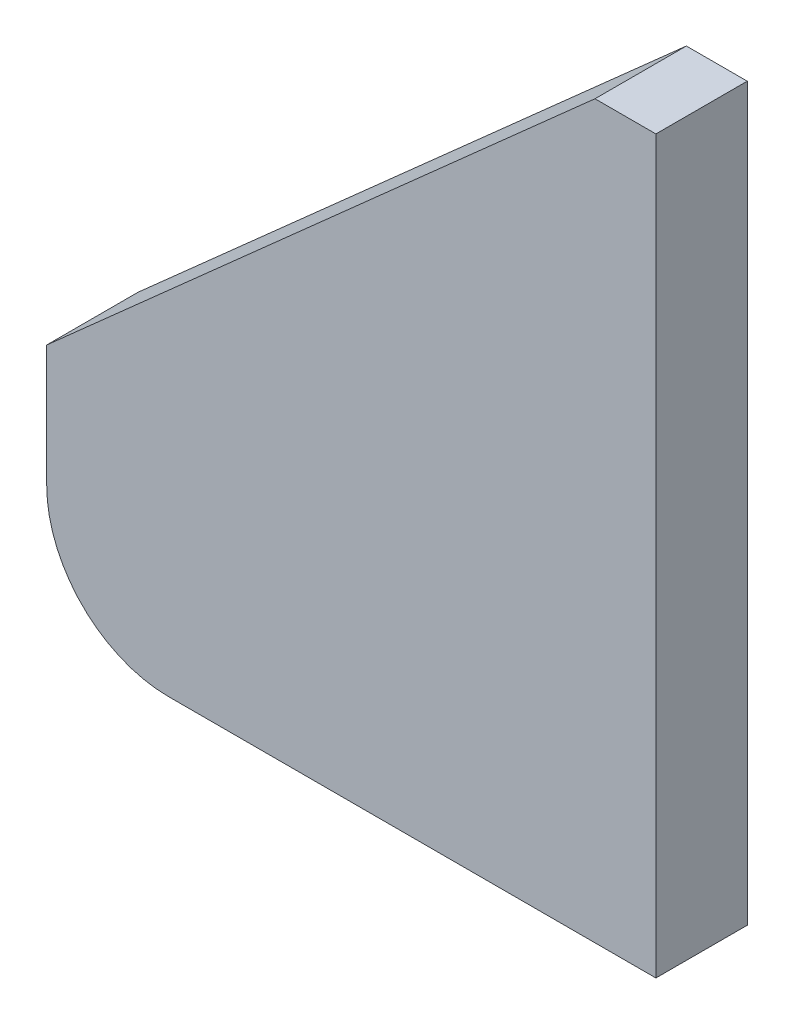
ISO-10303-21;
HEADER;
FILE_DESCRIPTION(('STEP AP214'),'2;1');
FILE_NAME('part.step','',(''),(''),'','','');
FILE_SCHEMA(('AUTOMOTIVE_DESIGN { 1 0 10303 214 1 1 1 1 }'));
ENDSEC;
DATA;
#1=APPLICATION_CONTEXT('core data for automotive mechanical design processes');
#2=APPLICATION_PROTOCOL_DEFINITION('international standard','automotive_design',2000,#1);
#3=PRODUCT_CONTEXT('',#1,'mechanical');
#4=PRODUCT('Part','Part','',(#3));
#5=PRODUCT_RELATED_PRODUCT_CATEGORY('part','',(#4));
#6=PRODUCT_DEFINITION_FORMATION('','',#4);
#7=PRODUCT_DEFINITION_CONTEXT('part definition',#1,'design');
#8=PRODUCT_DEFINITION('design','',#6,#7);
#9=PRODUCT_DEFINITION_SHAPE('','',#8);
#10=(LENGTH_UNIT() NAMED_UNIT(*) SI_UNIT(.MILLI.,.METRE.));
#11=(NAMED_UNIT(*) PLANE_ANGLE_UNIT() SI_UNIT($,.RADIAN.));
#12=(NAMED_UNIT(*) SI_UNIT($,.STERADIAN.) SOLID_ANGLE_UNIT());
#13=UNCERTAINTY_MEASURE_WITH_UNIT(LENGTH_MEASURE(1.E-05),#10,'distance_accuracy_value','');
#14=(GEOMETRIC_REPRESENTATION_CONTEXT(3) GLOBAL_UNCERTAINTY_ASSIGNED_CONTEXT((#13)) GLOBAL_UNIT_ASSIGNED_CONTEXT((#10,
#11,#12)) REPRESENTATION_CONTEXT('',''));
#15=CARTESIAN_POINT('',(0.,0.,0.));
#16=DIRECTION('',(0.,0.,1.));
#17=DIRECTION('',(1.,0.,0.));
#18=AXIS2_PLACEMENT_3D('',#15,#16,#17);
#19=CARTESIAN_POINT('',(-80.,20.,15.));
#20=DIRECTION('',(0.,0.,-1.));
#21=DIRECTION('',(-1.,0.,0.));
#22=AXIS2_PLACEMENT_3D('',#19,#20,#21);
#23=CYLINDRICAL_SURFACE('',#22,20.);
#24=CARTESIAN_POINT('',(-80.,20.,0.));
#25=DIRECTION('',(0.,0.,1.));
#26=DIRECTION('',(-1.,0.,0.));
#27=AXIS2_PLACEMENT_3D('',#24,#25,#26);
#28=CIRCLE('',#27,20.);
#29=CARTESIAN_POINT('',(-100.,20.0000000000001,0.));
#30=VERTEX_POINT('',#29);
#31=CARTESIAN_POINT('',(-79.9999999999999,0.,0.));
#32=VERTEX_POINT('',#31);
#33=EDGE_CURVE('E87',#30,#32,#28,.T.);
#34=ORIENTED_EDGE('',*,*,#33,.T.);
#35=DIRECTION('',(0.,0.,-1.));
#36=VECTOR('',#35,1.);
#37=CARTESIAN_POINT('',(-79.9999999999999,0.,15.));
#38=LINE('',#37,#36);
#39=CARTESIAN_POINT('',(-79.9999999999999,0.,15.));
#40=VERTEX_POINT('',#39);
#41=EDGE_CURVE('E11',#40,#32,#38,.T.);
#42=ORIENTED_EDGE('',*,*,#41,.F.);
#43=CARTESIAN_POINT('',(-80.,20.,15.));
#44=DIRECTION('',(0.,0.,1.));
#45=DIRECTION('',(-1.,0.,0.));
#46=AXIS2_PLACEMENT_3D('',#43,#44,#45);
#47=CIRCLE('',#46,20.);
#48=CARTESIAN_POINT('',(-100.,20.0000000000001,15.));
#49=VERTEX_POINT('',#48);
#50=EDGE_CURVE('E110',#49,#40,#47,.T.);
#51=ORIENTED_EDGE('',*,*,#50,.F.);
#52=DIRECTION('',(0.,0.,-1.));
#53=VECTOR('',#52,1.);
#54=CARTESIAN_POINT('',(-100.,20.0000000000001,15.));
#55=LINE('',#54,#53);
#56=EDGE_CURVE('E100',#49,#30,#55,.T.);
#57=ORIENTED_EDGE('',*,*,#56,.T.);
#58=EDGE_LOOP('',(#34,#42,#51,#57));
#59=FACE_BOUND('',#58,.T.);
#60=ADVANCED_FACE('F31',(#59),#23,.T.);
#61=CARTESIAN_POINT('',(-79.9999999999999,0.,15.));
#62=DIRECTION('',(0.,1.,0.));
#63=DIRECTION('',(0.,0.,1.));
#64=AXIS2_PLACEMENT_3D('',#61,#62,#63);
#65=PLANE('',#64);
#66=DIRECTION('',(1.,0.,0.));
#67=VECTOR('',#66,1.);
#68=CARTESIAN_POINT('',(-79.9999999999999,0.,0.));
#69=LINE('',#68,#67);
#70=CARTESIAN_POINT('',(0.,0.,0.));
#71=VERTEX_POINT('',#70);
#72=EDGE_CURVE('E83',#32,#71,#69,.T.);
#73=ORIENTED_EDGE('',*,*,#72,.T.);
#74=DIRECTION('',(0.,0.,-1.));
#75=VECTOR('',#74,1.);
#76=CARTESIAN_POINT('',(0.,0.,15.));
#77=LINE('',#76,#75);
#78=CARTESIAN_POINT('',(0.,0.,15.));
#79=VERTEX_POINT('',#78);
#80=EDGE_CURVE('E38',#79,#71,#77,.T.);
#81=ORIENTED_EDGE('',*,*,#80,.F.);
#82=DIRECTION('',(1.,0.,0.));
#83=VECTOR('',#82,1.);
#84=CARTESIAN_POINT('',(-79.9999999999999,0.,15.));
#85=LINE('',#84,#83);
#86=EDGE_CURVE('E96',#40,#79,#85,.T.);
#87=ORIENTED_EDGE('',*,*,#86,.F.);
#88=ORIENTED_EDGE('',*,*,#41,.T.);
#89=EDGE_LOOP('',(#73,#81,#87,#88));
#90=FACE_BOUND('',#89,.T.);
#91=ADVANCED_FACE('F95',(#90),#65,.F.);
#92=CARTESIAN_POINT('',(0.,120.,15.));
#93=DIRECTION('',(-1.,0.,0.));
#94=DIRECTION('',(0.,-1.,0.));
#95=AXIS2_PLACEMENT_3D('',#92,#93,#94);
#96=PLANE('',#95);
#97=DIRECTION('',(0.,1.,0.));
#98=VECTOR('',#97,1.);
#99=CARTESIAN_POINT('',(0.,120.,0.));
#100=LINE('',#99,#98);
#101=CARTESIAN_POINT('',(0.,120.,0.));
#102=VERTEX_POINT('',#101);
#103=EDGE_CURVE('E89',#71,#102,#100,.T.);
#104=ORIENTED_EDGE('',*,*,#103,.T.);
#105=DIRECTION('',(0.,0.,-1.));
#106=VECTOR('',#105,1.);
#107=CARTESIAN_POINT('',(0.,120.,15.));
#108=LINE('',#107,#106);
#109=CARTESIAN_POINT('',(0.,120.,15.));
#110=VERTEX_POINT('',#109);
#111=EDGE_CURVE('E126',#110,#102,#108,.T.);
#112=ORIENTED_EDGE('',*,*,#111,.F.);
#113=DIRECTION('',(0.,1.,0.));
#114=VECTOR('',#113,1.);
#115=CARTESIAN_POINT('',(0.,120.,15.));
#116=LINE('',#115,#114);
#117=EDGE_CURVE('E113',#79,#110,#116,.T.);
#118=ORIENTED_EDGE('',*,*,#117,.F.);
#119=ORIENTED_EDGE('',*,*,#80,.T.);
#120=EDGE_LOOP('',(#104,#112,#118,#119));
#121=FACE_BOUND('',#120,.T.);
#122=ADVANCED_FACE('F130',(#121),#96,.F.);
#123=CARTESIAN_POINT('',(-10.,120.,15.));
#124=DIRECTION('',(0.,-1.,0.));
#125=DIRECTION('',(0.,0.,-1.));
#126=AXIS2_PLACEMENT_3D('',#123,#124,#125);
#127=PLANE('',#126);
#128=DIRECTION('',(-1.,0.,0.));
#129=VECTOR('',#128,1.);
#130=CARTESIAN_POINT('',(-10.,120.,0.));
#131=LINE('',#130,#129);
#132=CARTESIAN_POINT('',(-10.,120.,0.));
#133=VERTEX_POINT('',#132);
#134=EDGE_CURVE('E104',#102,#133,#131,.T.);
#135=ORIENTED_EDGE('',*,*,#134,.T.);
#136=DIRECTION('',(0.,0.,-1.));
#137=VECTOR('',#136,1.);
#138=CARTESIAN_POINT('',(-10.,120.,15.));
#139=LINE('',#138,#137);
#140=CARTESIAN_POINT('',(-10.,120.,15.));
#141=VERTEX_POINT('',#140);
#142=EDGE_CURVE('E123',#141,#133,#139,.T.);
#143=ORIENTED_EDGE('',*,*,#142,.F.);
#144=DIRECTION('',(-1.,0.,0.));
#145=VECTOR('',#144,1.);
#146=CARTESIAN_POINT('',(-10.,120.,15.));
#147=LINE('',#146,#145);
#148=EDGE_CURVE('E115',#110,#141,#147,.T.);
#149=ORIENTED_EDGE('',*,*,#148,.F.);
#150=ORIENTED_EDGE('',*,*,#111,.T.);
#151=EDGE_LOOP('',(#135,#143,#149,#150));
#152=FACE_BOUND('',#151,.T.);
#153=ADVANCED_FACE('F136',(#152),#127,.F.);
#154=CARTESIAN_POINT('',(-10.,120.,15.));
#155=DIRECTION('',(0.66436383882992,-0.74740931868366,0.));
#156=DIRECTION('',(0.74740931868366,0.66436383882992,0.));
#157=AXIS2_PLACEMENT_3D('',#154,#155,#156);
#158=PLANE('',#157);
#159=DIRECTION('',(-0.74740931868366,-0.66436383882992,0.));
#160=VECTOR('',#159,1.);
#161=CARTESIAN_POINT('',(-10.,120.,0.));
#162=LINE('',#161,#160);
#163=CARTESIAN_POINT('',(-100.,40.,0.));
#164=VERTEX_POINT('',#163);
#165=EDGE_CURVE('E106',#133,#164,#162,.T.);
#166=ORIENTED_EDGE('',*,*,#165,.T.);
#167=DIRECTION('',(0.,0.,-1.));
#168=VECTOR('',#167,1.);
#169=CARTESIAN_POINT('',(-100.,40.,15.));
#170=LINE('',#169,#168);
#171=CARTESIAN_POINT('',(-100.,40.,15.));
#172=VERTEX_POINT('',#171);
#173=EDGE_CURVE('E120',#172,#164,#170,.T.);
#174=ORIENTED_EDGE('',*,*,#173,.F.);
#175=DIRECTION('',(-0.74740931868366,-0.66436383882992,0.));
#176=VECTOR('',#175,1.);
#177=CARTESIAN_POINT('',(-10.,120.,15.));
#178=LINE('',#177,#176);
#179=EDGE_CURVE('E50',#141,#172,#178,.T.);
#180=ORIENTED_EDGE('',*,*,#179,.F.);
#181=ORIENTED_EDGE('',*,*,#142,.T.);
#182=EDGE_LOOP('',(#166,#174,#180,#181));
#183=FACE_BOUND('',#182,.T.);
#184=ADVANCED_FACE('F139',(#183),#158,.F.);
#185=CARTESIAN_POINT('',(-100.,40.,15.));
#186=DIRECTION('',(1.,0.,0.));
#187=DIRECTION('',(0.,0.,-1.));
#188=AXIS2_PLACEMENT_3D('',#185,#186,#187);
#189=PLANE('',#188);
#190=DIRECTION('',(0.,-1.,0.));
#191=VECTOR('',#190,1.);
#192=CARTESIAN_POINT('',(-100.,40.,0.));
#193=LINE('',#192,#191);
#194=EDGE_CURVE('E108',#164,#30,#193,.T.);
#195=ORIENTED_EDGE('',*,*,#194,.T.);
#196=ORIENTED_EDGE('',*,*,#56,.F.);
#197=DIRECTION('',(0.,-1.,0.));
#198=VECTOR('',#197,1.);
#199=CARTESIAN_POINT('',(-100.,40.,15.));
#200=LINE('',#199,#198);
#201=EDGE_CURVE('E45',#172,#49,#200,.T.);
#202=ORIENTED_EDGE('',*,*,#201,.F.);
#203=ORIENTED_EDGE('',*,*,#173,.T.);
#204=EDGE_LOOP('',(#195,#196,#202,#203));
#205=FACE_BOUND('',#204,.T.);
#206=ADVANCED_FACE('F141',(#205),#189,.F.);
#207=CARTESIAN_POINT('',(-80.,20.,15.));
#208=DIRECTION('',(0.,0.,-1.));
#209=DIRECTION('',(-1.,0.,0.));
#210=AXIS2_PLACEMENT_3D('',#207,#208,#209);
#211=PLANE('',#210);
#212=ORIENTED_EDGE('',*,*,#50,.T.);
#213=ORIENTED_EDGE('',*,*,#86,.T.);
#214=ORIENTED_EDGE('',*,*,#117,.T.);
#215=ORIENTED_EDGE('',*,*,#148,.T.);
#216=ORIENTED_EDGE('',*,*,#179,.T.);
#217=ORIENTED_EDGE('',*,*,#201,.T.);
#218=EDGE_LOOP('',(#212,#213,#214,#215,#216,#217));
#219=FACE_BOUND('',#218,.T.);
#220=ADVANCED_FACE('F133',(#219),#211,.F.);
#221=CARTESIAN_POINT('',(-80.,20.,0.));
#222=DIRECTION('',(0.,0.,-1.));
#223=DIRECTION('',(-1.,0.,0.));
#224=AXIS2_PLACEMENT_3D('',#221,#222,#223);
#225=PLANE('',#224);
#226=ORIENTED_EDGE('',*,*,#33,.F.);
#227=ORIENTED_EDGE('',*,*,#194,.F.);
#228=ORIENTED_EDGE('',*,*,#165,.F.);
#229=ORIENTED_EDGE('',*,*,#134,.F.);
#230=ORIENTED_EDGE('',*,*,#103,.F.);
#231=ORIENTED_EDGE('',*,*,#72,.F.);
#232=EDGE_LOOP('',(#226,#227,#228,#229,#230,#231));
#233=FACE_BOUND('',#232,.T.);
#234=ADVANCED_FACE('F84',(#233),#225,.T.);
#235=CLOSED_SHELL('',(#60,#91,#122,#153,#184,#206,#220,#234));
#236=MANIFOLD_SOLID_BREP('B2',#235);
#237=ADVANCED_BREP_SHAPE_REPRESENTATION('',(#18,#236),#14);
#238=SHAPE_DEFINITION_REPRESENTATION(#9,#237);
ENDSEC;
END-ISO-10303-21;
